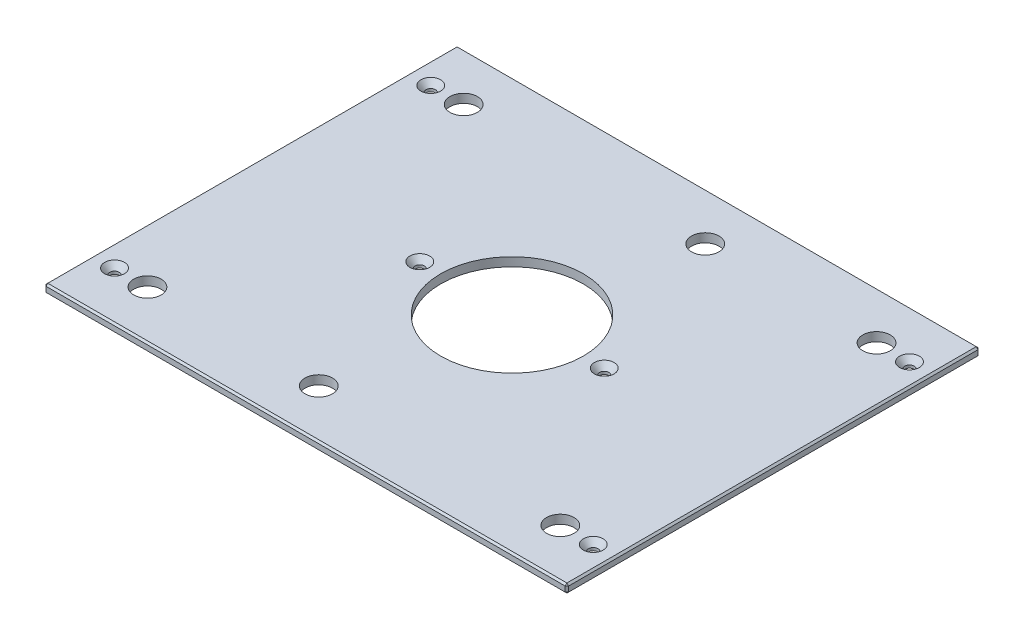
from build123d import *

# Parameters (mm, degrees)
SKETCH1_W                                     = 377.825
SKETCH1_H                                     = 298.45
BOSS_EXTRUDE1_DEPTH                           = 6.35
SKETCH13_R                                    = 51.562
CUT_EXTRUDE6_DEPTH                            = 241.82432556
F_25_32_0_78125_DIAMETER_HOLE1_D              = 19.84375
CHAMFER2_SIZE                                 = 1.27
CSK_FOR_1_4_FLAT_HEAD_MACHINE_SCREW1_AT_COUNT = 2
CSK_FOR_1_4_FLAT_HEAD_MACHINE_SCREW1_AT_PITCH = 228.6
CSK_FOR_1_4_FLAT_HEAD_MACHINE_SCREW1_2_COUNT  = 2
CSK_FOR_1_4_FLAT_HEAD_MACHINE_SCREW1_2_PITCH  = 414.760009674
CSK_FOR_1_4_FLAT_HEAD_MACHINE_SCREW1_3_COUNT  = 2
CSK_FOR_1_4_FLAT_HEAD_MACHINE_SCREW1_3_PITCH  = 265.568395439
CSK_FOR_1_4_FLAT_HEAD_MACHINE_SCREW1_4_COUNT  = 2
CSK_FOR_1_4_FLAT_HEAD_MACHINE_SCREW1_4_PITCH  = 156.132864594
CSK_FOR_1_4_FLAT_HEAD_MACHINE_SCREW1_5_COUNT  = 2
CSK_FOR_1_4_FLAT_HEAD_MACHINE_SCREW1_5_PITCH  = 346.075
CSK_FOR_1_4_FLAT_HEAD_MACHINE_SCREW1_6_COUNT  = 2
CSK_FOR_1_4_FLAT_HEAD_MACHINE_SCREW1_6_PITCH  = 322.2625
CSK_FOR_1_4_FLAT_HEAD_MACHINE_SCREW1_7_COUNT  = 2
CSK_FOR_1_4_FLAT_HEAD_MACHINE_SCREW1_7_PITCH  = 395.108945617


with BuildPart() as part:
    # Sketch1 → Boss-Extrude1 (new body)
    with BuildSketch(Plane(origin=(0, 0, 0), x_dir=(1, 0, 0), z_dir=(0, 1, 0))):
        Rectangle(SKETCH1_W, SKETCH1_H)
    extrude(amount=BOSS_EXTRUDE1_DEPTH)

    # Sketch13 → Cut-Extrude6 (cut, through all)
    with BuildSketch(Plane(origin=(0, 6.35, 0), x_dir=(1, 0, 0), z_dir=(0, 1, 0))):
        with Locations(Location((0, 0, 0), (0, 0, 270))):
            Circle(SKETCH13_R)
    extrude(amount=-CUT_EXTRUDE6_DEPTH, mode=Mode.SUBTRACT)

    # 25_32 _0.78125_ Diameter Hole1 (through all)
    with Locations(Plane(origin=(0, 6.35, 0), x_dir=(1, 0, 0), z_dir=(0, 1, 0))):
        with Locations((149.225, 114.3), (-149.225, 114.3), (149.225, -114.3), (-149.225, -114.3), (25.4, 114.3), (-25.4, -114.3)):
            Hole(F_25_32_0_78125_DIAMETER_HOLE1_D / 2)

    # Chamfer2
    chamfer2_edges = [part.edges().sort_by_distance(p)[0] for p in [
        (188.9125, 6.35, 0),
        (0, 6.35, -149.225),
        (-188.9125, 6.35, 0),
        (0, 0, -149.225),
        (188.9125, 0, 0),
        (0, 0, 149.225),
        (-188.9125, 0, 0),
        (0, 6.35, 149.225),
        (-188.9125, 3.175, -149.225),
        (188.9125, 3.175, -149.225),
        (188.9125, 3.175, 149.225),
        (-188.9125, 3.175, 149.225),
    ]]
    chamfer(chamfer2_edges, length=CHAMFER2_SIZE)

    # Sketch24 → CSK for 1_4 Flat Head Machine Screw1 (revolve, cut)
    with BuildSketch(Plane(origin=(173.0375, 6.35, -114.3), x_dir=(0, 0, 1), z_dir=(1, 0, 0))):
        Polygon((0, 0), (0, 6.35), (3.3782, 6.35), (3.3782, 4.324464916), (7.1374, 0), align=None)
    csk_for_1_4_flat_head_machine_screw1 = revolve(axis=Axis((173.0375, 12.7, -114.3), (0, -1, 0)), mode=Mode.SUBTRACT)

    # CSK for 1_4 Flat Head Machine Screw1 at: CSK for 1_4 Flat Head Machine Screw1 ×2
    with Locations(*[(0, 0, i * CSK_FOR_1_4_FLAT_HEAD_MACHINE_SCREW1_AT_PITCH) for i in range(1, CSK_FOR_1_4_FLAT_HEAD_MACHINE_SCREW1_AT_COUNT)]):
        add(csk_for_1_4_flat_head_machine_screw1, mode=Mode.SUBTRACT)

    # CSK for 1_4 Flat Head Machine Screw1 2: CSK for 1_4 Flat Head Machine Screw1 ×2
    with Locations(*[Vector(-0.8343981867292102, 0, 0.5511621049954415) * (i * CSK_FOR_1_4_FLAT_HEAD_MACHINE_SCREW1_2_PITCH) for i in range(1, CSK_FOR_1_4_FLAT_HEAD_MACHINE_SCREW1_2_COUNT)]):
        add(csk_for_1_4_flat_head_machine_screw1, mode=Mode.SUBTRACT)

    # CSK for 1_4 Flat Head Machine Screw1 3: CSK for 1_4 Flat Head Machine Screw1 ×2
    with Locations(*[Vector(-0.9026394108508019, 0, 0.430397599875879) * (i * CSK_FOR_1_4_FLAT_HEAD_MACHINE_SCREW1_3_PITCH) for i in range(1, CSK_FOR_1_4_FLAT_HEAD_MACHINE_SCREW1_3_COUNT)]):
        add(csk_for_1_4_flat_head_machine_screw1, mode=Mode.SUBTRACT)

    # CSK for 1_4 Flat Head Machine Screw1 4: CSK for 1_4 Flat Head Machine Screw1 ×2
    with Locations(*[Vector(-0.6812306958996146, 0, 0.732068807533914) * (i * CSK_FOR_1_4_FLAT_HEAD_MACHINE_SCREW1_4_PITCH) for i in range(1, CSK_FOR_1_4_FLAT_HEAD_MACHINE_SCREW1_4_COUNT)]):
        add(csk_for_1_4_flat_head_machine_screw1, mode=Mode.SUBTRACT)

    # CSK for 1_4 Flat Head Machine Screw1 5: CSK for 1_4 Flat Head Machine Screw1 ×2
    with Locations(*[(-i * CSK_FOR_1_4_FLAT_HEAD_MACHINE_SCREW1_5_PITCH, 0, 0) for i in range(1, CSK_FOR_1_4_FLAT_HEAD_MACHINE_SCREW1_5_COUNT)]):
        add(csk_for_1_4_flat_head_machine_screw1, mode=Mode.SUBTRACT)

    # CSK for 1_4 Flat Head Machine Screw1 6: CSK for 1_4 Flat Head Machine Screw1 ×2
    with Locations(*[(-i * CSK_FOR_1_4_FLAT_HEAD_MACHINE_SCREW1_6_PITCH, 0, 0) for i in range(1, CSK_FOR_1_4_FLAT_HEAD_MACHINE_SCREW1_6_COUNT)]):
        add(csk_for_1_4_flat_head_machine_screw1, mode=Mode.SUBTRACT)

    # CSK for 1_4 Flat Head Machine Screw1 7: CSK for 1_4 Flat Head Machine Screw1 ×2
    with Locations(*[Vector(-0.8156294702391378, 0, 0.5785745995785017) * (i * CSK_FOR_1_4_FLAT_HEAD_MACHINE_SCREW1_7_PITCH) for i in range(1, CSK_FOR_1_4_FLAT_HEAD_MACHINE_SCREW1_7_COUNT)]):
        add(csk_for_1_4_flat_head_machine_screw1, mode=Mode.SUBTRACT)


solid = part.part
